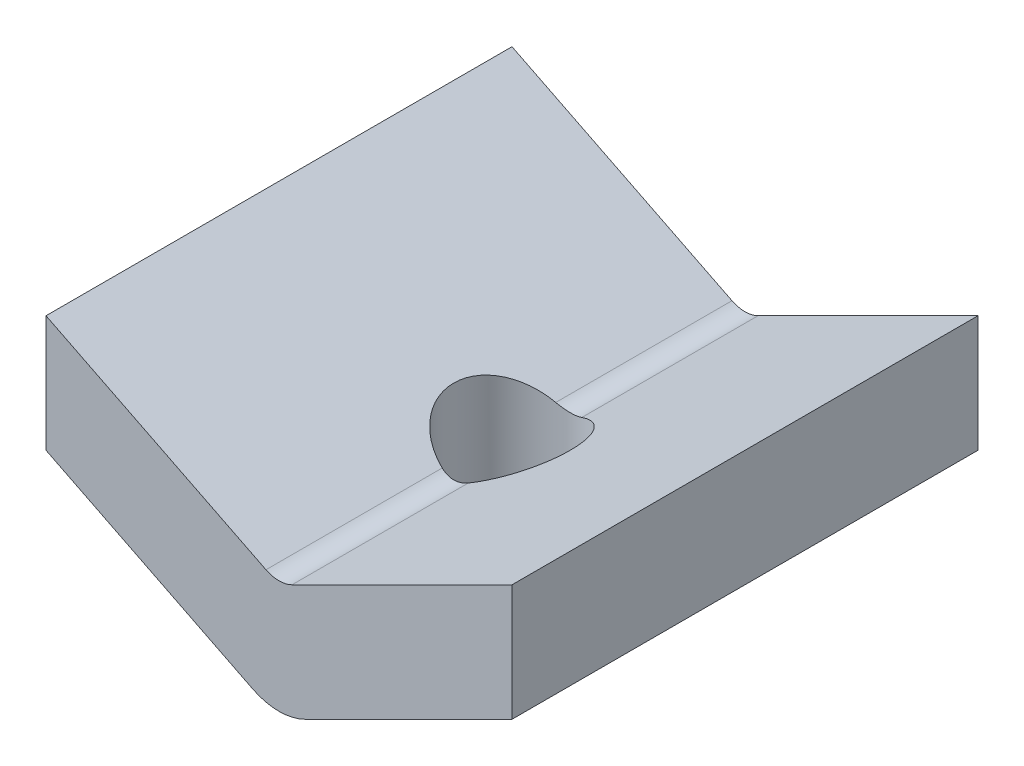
from build123d import *

# Parameters (mm, degrees)
EXTRUSION1_DEPTH        = 4
ESQUISSE2_R             = 1
ENL_V_MAT_EXTRU_1_DEPTH = 7.92820323


with BuildPart() as part:
    # Esquisse1 → Extrusion1 (new, symmetric)
    with BuildSketch(Plane.XY):
        with BuildLine():
            Line((0.447213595, 0.223606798), (4, 2))
            Line((4, 2), (4, 4))
            Line((4, 4), (0.223606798, 2.111803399))
            ThreePointArc((0.223606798, 2.111803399), (0, 2.059016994), (-0.223606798, 2.111803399))
            Line((-0.223606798, 2.111803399), (-4, 4))
            Line((-4, 4), (-4, 2))
            Line((-4, 2), (-0.447213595, 0.223606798))
            ThreePointArc((-0.447213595, 0.223606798), (0, 0.118033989), (0.447213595, 0.223606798))
        make_face()
    extrude(amount=EXTRUSION1_DEPTH, both=True)

    # Esquisse2 → Enl_v. mat.-Extru.1 (cut, through all)
    with BuildSketch(Plane(origin=(0, 0, 0), x_dir=(1, 0, 0), z_dir=(0, 1, 0))):
        with Locations(Location((0, 0, 0), (0, 0, 77.079052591))):
            Circle(ESQUISSE2_R)
    extrude(amount=ENL_V_MAT_EXTRU_1_DEPTH, mode=Mode.SUBTRACT)


solid = part.part
